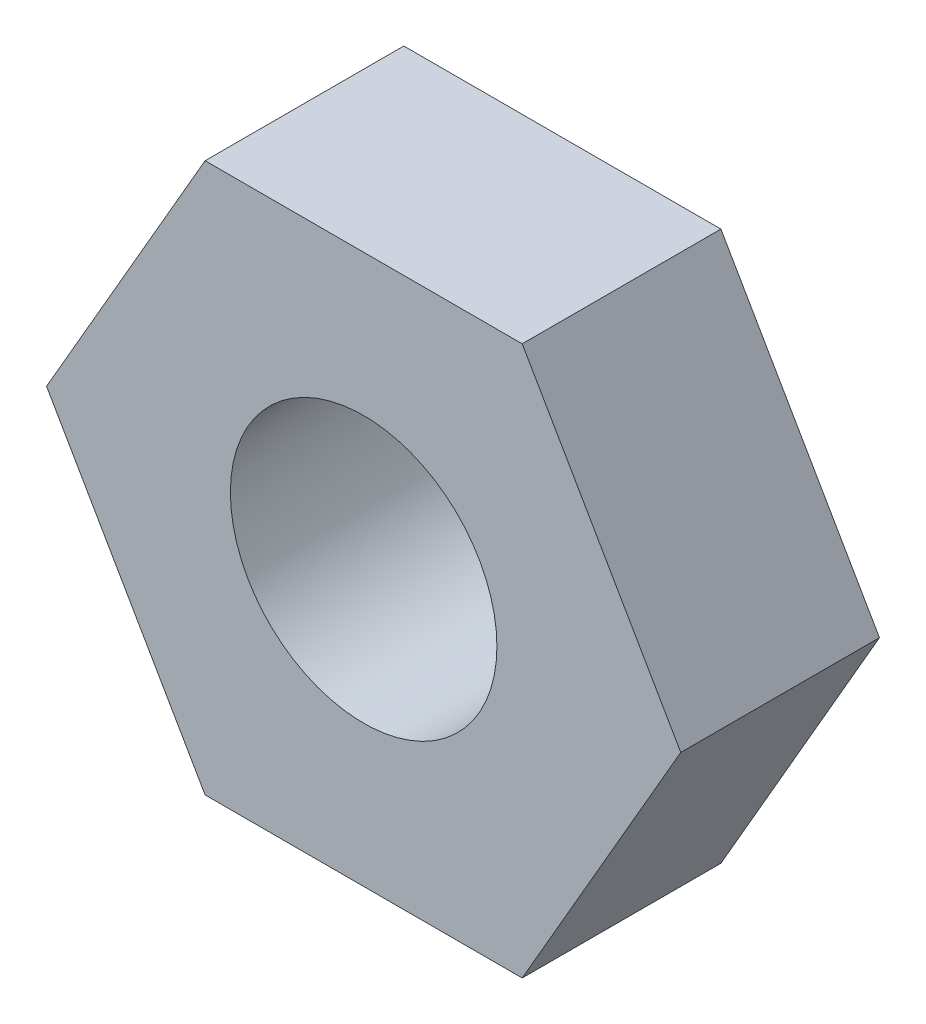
from build123d import *

# Parameters (mm, degrees)
BOSS_EXTRUDE1_DEPTH = 3.1242
SKETCH2_R           = 2.0955
CUT_EXTRUDE1_DEPTH  = 8.298350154


with BuildPart() as part:
    # Sketch1 → Boss-Extrude1 (new body)
    with BuildSketch(Plane.XY):
        Polygon((4.985996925, 0), (2.492998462, 4.318), (-2.492998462, 4.318), (-4.985996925, 0), (-2.492998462, -4.318), (2.492998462, -4.318), align=None)
    extrude(amount=BOSS_EXTRUDE1_DEPTH)

    # Sketch2 → Cut-Extrude1 (cut, through all)
    with BuildSketch(Plane.XY.offset(3.1242)):
        Circle(SKETCH2_R)
    extrude(amount=-CUT_EXTRUDE1_DEPTH, mode=Mode.SUBTRACT)


solid = part.part
